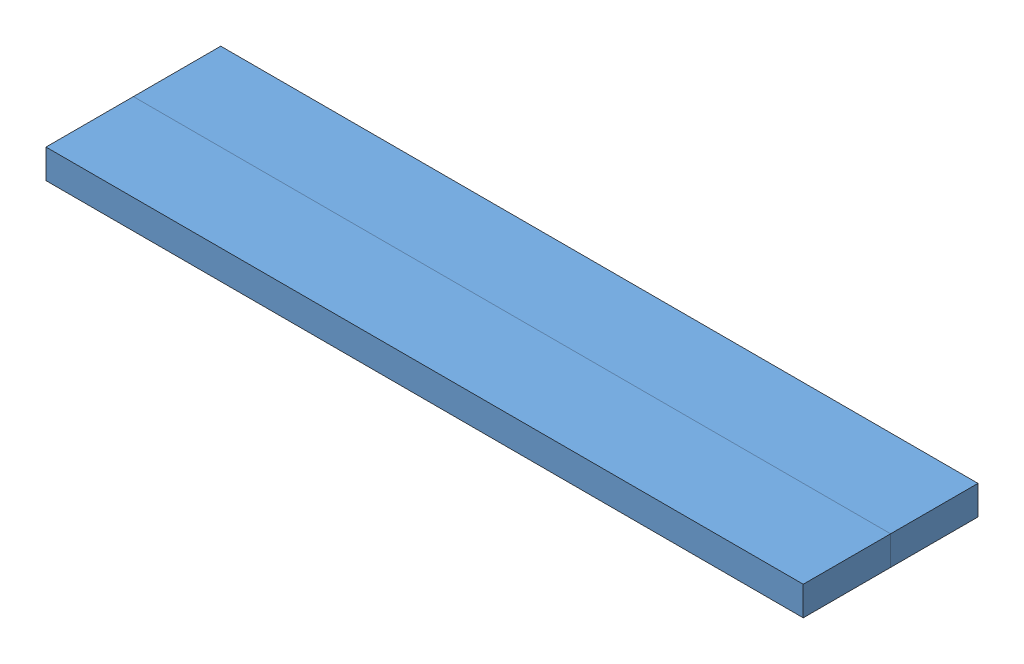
SolidWorks assembly Popsicle Stick Assembly.SLDASM, configuration Default (file format 13000). Lengths in mm.
Overall size (82.55 3.17 19.05).
2 component instances, 1 part files, 3 mates.
Components (placement in the parent):
- Cut Popsicle Stick-1: Cut Popsicle Stick.SLDPRT [Default] at (0.2294 53.1924 72.6323) size (82.55 3.17 9.53)
- Cut Popsicle Stick-2: Cut Popsicle Stick.SLDPRT [Default] at (0.2294 53.1924 82.1573) size (82.55 3.17 9.53)
Mates (geometry in assembly coordinates):
- Coincident1: coincident anti-aligned: plane of Cut Popsicle Stick-1 through (0.2294 56.3674 72.6323) normal (0 0 1); plane of Cut Popsicle Stick-2 through (0.2294 56.3674 72.6323) normal (0 0 -1)
- Coincident2: coincident aligned: plane of Cut Popsicle Stick-1 through (0.2294 56.3674 72.6323) normal (0 1 0); plane of Cut Popsicle Stick-2 through (0.2294 56.3674 82.1573) normal (0 1 0)
- Coincident3: coincident aligned: plane of Cut Popsicle Stick-1 through (82.7794 56.3674 72.6323) normal (1 0 0); plane of Cut Popsicle Stick-2 through (82.7794 56.3674 82.1573) normal (1 0 0)
